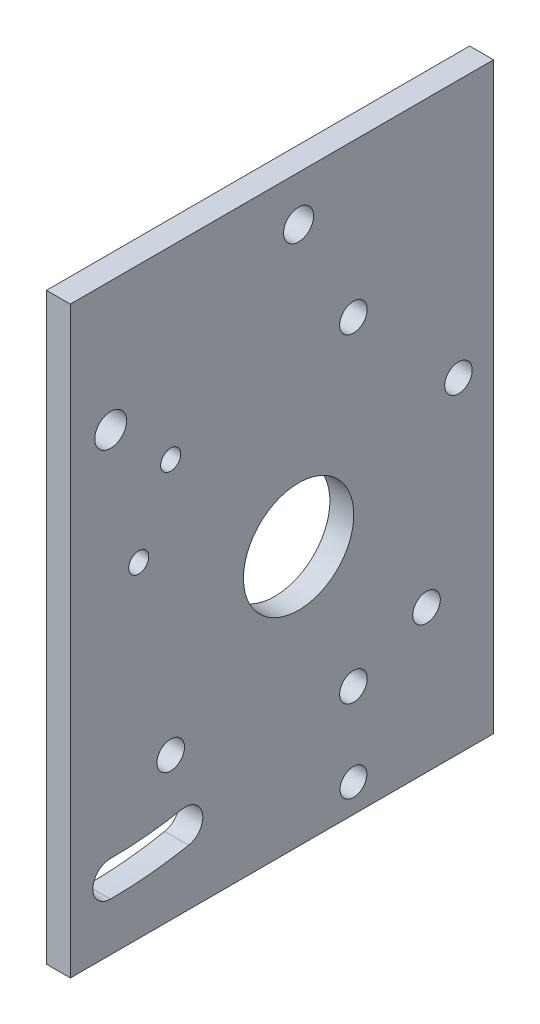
from build123d import *

# Parameters (mm, degrees)
SKETCH1_W           = 84.371353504
SKETCH1_H           = 116.359920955
SKETCH1_R           = 11
SKETCH1_R_2         = 2
SKETCH1_R_3         = 2.75
SKETCH1_R_4         = 2.671605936
SKETCH1_R_5         = 3
SKETCH1_R_6         = 3.175
BOSS_EXTRUDE1_DEPTH = 4.7625


with BuildPart() as part:
    # Sketch1 → Boss-Extrude1 (new body)
    with BuildSketch(Plane(origin=(0, 0, 0), x_dir=(0, 0, -1), z_dir=(1, 0, 0))):
        with Locations((-3.321298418, 6.43636121)):
            Rectangle(SKETCH1_W, SKETCH1_H)
        with Locations(Location((0, 0, 0), (0, 0, 180))):
            Circle(SKETCH1_R, mode=Mode.SUBTRACT)
        with Locations(Location((-25.5, 27.762099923, 0), (0, 0, 180))):
            Circle(SKETCH1_R_2, mode=Mode.SUBTRACT)
        with Locations(Location((10.937687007, 34.137099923, 0), (0, 0, 180))):
            Circle(SKETCH1_R_3, mode=Mode.SUBTRACT)
        with Locations(Location((10.937687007, -29.612900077, 0), (0, 0, 180))):
            Circle(SKETCH1_R_3, mode=Mode.SUBTRACT)
        with Locations(Location((25.5, -23.237900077, 0), (0, 0, 180))):
            Circle(SKETCH1_R_3, mode=Mode.SUBTRACT)
        with Locations(Location((31.875, 13.19978693, 0), (0, 0, 180))):
            Circle(SKETCH1_R_3, mode=Mode.SUBTRACT)
        with Locations(Location((-31.875, 13.19978693, 0), (0, 0, 180))):
            Circle(SKETCH1_R_2, mode=Mode.SUBTRACT)
        with Locations(Location((-25.5, -23.237900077, 0), (0, 0, 180))):
            Circle(SKETCH1_R_3, mode=Mode.SUBTRACT)
        with Locations(Location((10.937687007, -46.112075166, 0), (0, 0, 180))):
            Circle(SKETCH1_R_4, mode=Mode.SUBTRACT)
        with Locations(Location((0, 55.616321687, 0), (0, 0, 180))):
            Circle(SKETCH1_R_5, mode=Mode.SUBTRACT)
        with Locations(Location((-37.468241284, 38.886127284, 0), (0, 0, 180))):
            Circle(SKETCH1_R_6, mode=Mode.SUBTRACT)
        with BuildLine():
            ThreePointArc((-37.525793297, -42.113852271), (-29.68681547, -41.739237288), (-21.920884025, -40.607769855))
            ThreePointArc((-21.920884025, -40.607769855), (-19.157761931, -36.501048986), (-23.2644828, -33.737926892))
            ThreePointArc((-23.2644828, -33.737926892), (-30.359284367, -34.771613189), (-37.520819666, -35.113854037))
            ThreePointArc((-37.520819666, -35.113854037), (-41.023305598, -38.611366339), (-37.525793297, -42.113852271))
        make_face(mode=Mode.SUBTRACT)
    extrude(amount=BOSS_EXTRUDE1_DEPTH)


solid = part.part
